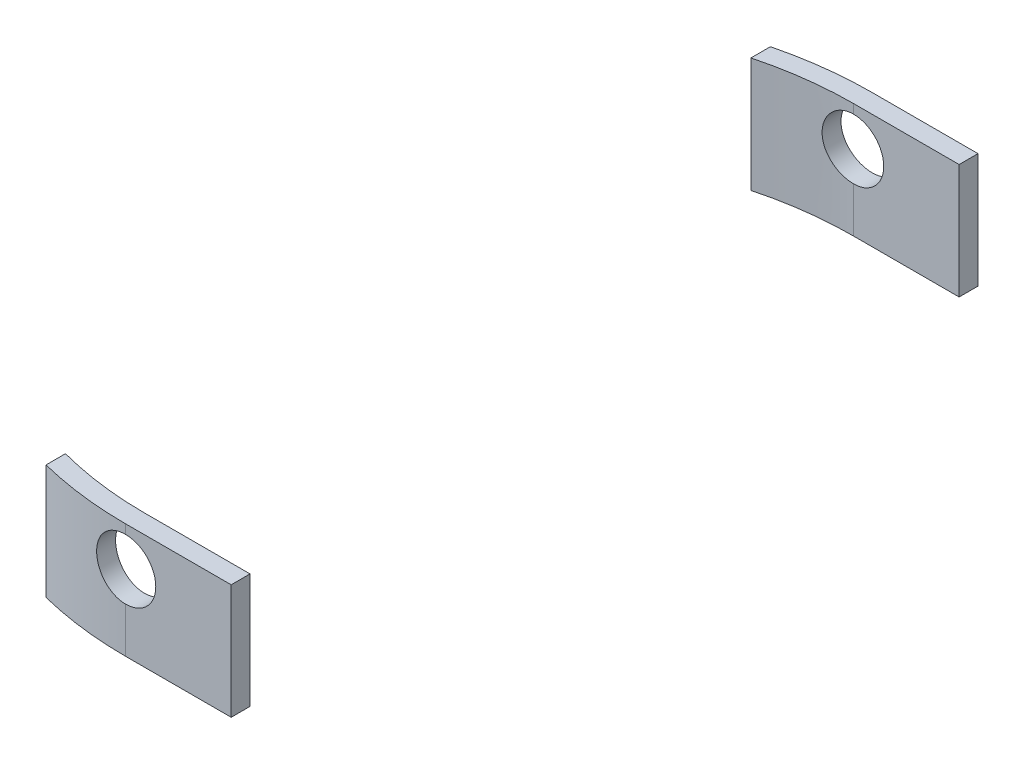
ISO-10303-21;
HEADER;
FILE_DESCRIPTION(('STEP AP214'),'2;1');
FILE_NAME('part.step','',(''),(''),'','','');
FILE_SCHEMA(('AUTOMOTIVE_DESIGN { 1 0 10303 214 1 1 1 1 }'));
ENDSEC;
DATA;
#1=APPLICATION_CONTEXT('core data for automotive mechanical design processes');
#2=APPLICATION_PROTOCOL_DEFINITION('international standard','automotive_design',2000,#1);
#3=PRODUCT_CONTEXT('',#1,'mechanical');
#4=PRODUCT('Part','Part','',(#3));
#5=PRODUCT_RELATED_PRODUCT_CATEGORY('part','',(#4));
#6=PRODUCT_DEFINITION_FORMATION('','',#4);
#7=PRODUCT_DEFINITION_CONTEXT('part definition',#1,'design');
#8=PRODUCT_DEFINITION('design','',#6,#7);
#9=PRODUCT_DEFINITION_SHAPE('','',#8);
#10=(LENGTH_UNIT() NAMED_UNIT(*) SI_UNIT(.MILLI.,.METRE.));
#11=(NAMED_UNIT(*) PLANE_ANGLE_UNIT() SI_UNIT($,.RADIAN.));
#12=(NAMED_UNIT(*) SI_UNIT($,.STERADIAN.) SOLID_ANGLE_UNIT());
#13=UNCERTAINTY_MEASURE_WITH_UNIT(LENGTH_MEASURE(1.E-05),#10,'distance_accuracy_value','');
#14=(GEOMETRIC_REPRESENTATION_CONTEXT(3) GLOBAL_UNCERTAINTY_ASSIGNED_CONTEXT((#13)) GLOBAL_UNIT_ASSIGNED_CONTEXT((#10,
#11,#12)) REPRESENTATION_CONTEXT('',''));
#15=CARTESIAN_POINT('',(0.,0.,0.));
#16=DIRECTION('',(0.,0.,1.));
#17=DIRECTION('',(1.,0.,0.));
#18=AXIS2_PLACEMENT_3D('',#15,#16,#17);
#19=CARTESIAN_POINT('',(0.,18.3,0.));
#20=DIRECTION('',(0.,1.,0.));
#21=DIRECTION('',(0.,0.,1.));
#22=AXIS2_PLACEMENT_3D('',#19,#20,#21);
#23=PLANE('',#22);
#24=DIRECTION('',(0.,0.,-1.));
#25=VECTOR('',#24,1.);
#26=CARTESIAN_POINT('',(-4.81519163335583,18.3,0.));
#27=LINE('',#26,#25);
#28=CARTESIAN_POINT('',(-4.81519163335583,18.3,19.2055702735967));
#29=VERTEX_POINT('',#28);
#30=CARTESIAN_POINT('',(-4.81519163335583,18.3,18.1728899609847));
#31=VERTEX_POINT('',#30);
#32=EDGE_CURVE('E88',#29,#31,#27,.T.);
#33=ORIENTED_EDGE('',*,*,#32,.F.);
#34=CARTESIAN_POINT('',(0.,18.3,0.));
#35=DIRECTION('',(0.,1.,0.));
#36=DIRECTION('',(0.,0.,1.));
#37=AXIS2_PLACEMENT_3D('',#34,#35,#36);
#38=CIRCLE('',#37,19.8);
#39=CARTESIAN_POINT('',(0.,18.3,19.8));
#40=VERTEX_POINT('',#39);
#41=EDGE_CURVE('E195',#29,#40,#38,.T.);
#42=ORIENTED_EDGE('',*,*,#41,.T.);
#43=DIRECTION('',(1.,0.,0.));
#44=VECTOR('',#43,1.);
#45=CARTESIAN_POINT('',(0.,18.3,19.8));
#46=LINE('',#45,#44);
#47=CARTESIAN_POINT('',(5.59934207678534,18.3,19.8));
#48=VERTEX_POINT('',#47);
#49=EDGE_CURVE('E197',#40,#48,#46,.T.);
#50=ORIENTED_EDGE('',*,*,#49,.T.);
#51=DIRECTION('',(0.,0.,1.));
#52=VECTOR('',#51,1.);
#53=CARTESIAN_POINT('',(5.59934207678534,18.3,0.));
#54=LINE('',#53,#52);
#55=CARTESIAN_POINT('',(5.59934207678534,18.3,18.8));
#56=VERTEX_POINT('',#55);
#57=EDGE_CURVE('E134',#56,#48,#54,.T.);
#58=ORIENTED_EDGE('',*,*,#57,.F.);
#59=DIRECTION('',(1.,0.,0.));
#60=VECTOR('',#59,1.);
#61=CARTESIAN_POINT('',(7.59934207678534,18.3,18.8));
#62=LINE('',#61,#60);
#63=CARTESIAN_POINT('',(0.,18.3,18.8));
#64=VERTEX_POINT('',#63);
#65=EDGE_CURVE('E135',#64,#56,#62,.T.);
#66=ORIENTED_EDGE('',*,*,#65,.F.);
#67=CARTESIAN_POINT('',(0.,18.3,0.));
#68=DIRECTION('',(0.,1.,0.));
#69=DIRECTION('',(0.,0.,1.));
#70=AXIS2_PLACEMENT_3D('',#67,#68,#69);
#71=CIRCLE('',#70,18.8);
#72=EDGE_CURVE('E144',#31,#64,#71,.T.);
#73=ORIENTED_EDGE('',*,*,#72,.F.);
#74=EDGE_LOOP('',(#33,#42,#50,#58,#66,#73));
#75=FACE_BOUND('',#74,.T.);
#76=ADVANCED_FACE('F50',(#75),#23,.T.);
#77=CARTESIAN_POINT('',(0.,-57.0073400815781,0.));
#78=DIRECTION('',(0.,1.,0.));
#79=DIRECTION('',(0.,0.,1.));
#80=AXIS2_PLACEMENT_3D('',#77,#78,#79);
#81=CYLINDRICAL_SURFACE('',#80,19.8);
#82=DIRECTION('',(0.,1.,0.));
#83=VECTOR('',#82,1.);
#84=CARTESIAN_POINT('',(-4.81519163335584,-57.0073400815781,19.2055702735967));
#85=LINE('',#84,#83);
#86=CARTESIAN_POINT('',(-4.81519163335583,12.2142492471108,19.2055702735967));
#87=VERTEX_POINT('',#86);
#88=EDGE_CURVE('E198',#87,#29,#85,.T.);
#89=ORIENTED_EDGE('',*,*,#88,.F.);
#90=CARTESIAN_POINT('',(0.,12.2142492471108,0.));
#91=DIRECTION('',(0.,1.,0.));
#92=DIRECTION('',(0.,0.,1.));
#93=AXIS2_PLACEMENT_3D('',#90,#91,#92);
#94=CIRCLE('',#93,19.8);
#95=CARTESIAN_POINT('',(0.,12.2142492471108,19.8));
#96=VERTEX_POINT('',#95);
#97=EDGE_CURVE('E60',#96,#87,#94,.F.);
#98=ORIENTED_EDGE('',*,*,#97,.F.);
#99=DIRECTION('',(0.,1.,0.));
#100=VECTOR('',#99,1.);
#101=CARTESIAN_POINT('',(0.,-57.0073400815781,19.8));
#102=LINE('',#101,#100);
#103=CARTESIAN_POINT('',(0.,14.6125,19.8));
#104=VERTEX_POINT('',#103);
#105=EDGE_CURVE('E210',#96,#104,#102,.T.);
#106=ORIENTED_EDGE('',*,*,#105,.T.);
#107=CARTESIAN_POINT('',(0.,17.8125,19.8));
#108=CARTESIAN_POINT('',(-0.0449365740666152,17.8124997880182,19.800000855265));
#109=CARTESIAN_POINT('',(-0.0898515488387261,17.8106057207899,19.799846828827));
#110=CARTESIAN_POINT('',(-0.179358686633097,17.8030500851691,19.7992380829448));
#111=CARTESIAN_POINT('',(-0.223950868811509,17.7973887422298,19.7987833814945));
#112=CARTESIAN_POINT('',(-0.3566787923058,17.7748098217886,19.7969839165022));
#113=CARTESIAN_POINT('',(-0.44392318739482,17.7522971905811,19.7952037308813));
#114=CARTESIAN_POINT('',(-0.613375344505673,17.6929875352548,19.7906791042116));
#115=CARTESIAN_POINT('',(-0.695581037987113,17.6561846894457,19.7879342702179));
#116=CARTESIAN_POINT('',(-0.852648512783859,17.5693483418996,19.7817888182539));
#117=CARTESIAN_POINT('',(-0.927511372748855,17.5193167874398,19.7783882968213));
#118=CARTESIAN_POINT('',(-1.06793655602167,17.4073201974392,19.7713043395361));
#119=CARTESIAN_POINT('',(-1.13347956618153,17.345330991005,19.7676203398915));
#120=CARTESIAN_POINT('',(-1.25325144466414,17.2112212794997,19.7603889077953));
#121=CARTESIAN_POINT('',(-1.30747858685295,17.1390992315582,19.7568414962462));
#122=CARTESIAN_POINT('',(-1.40313531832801,16.9866571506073,19.7502790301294));
#123=CARTESIAN_POINT('',(-1.44454760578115,16.9063262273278,19.7472646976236));
#124=CARTESIAN_POINT('',(-1.51328655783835,16.73982775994,19.7421163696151));
#125=CARTESIAN_POINT('',(-1.54061431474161,16.6536606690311,19.7399823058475));
#126=CARTESIAN_POINT('',(-1.58035441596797,16.4781308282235,19.7368406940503));
#127=CARTESIAN_POINT('',(-1.59279919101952,16.3887754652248,19.7358306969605));
#128=CARTESIAN_POINT('',(-1.60252032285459,16.209236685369,19.7350437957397));
#129=CARTESIAN_POINT('',(-1.59979657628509,16.1190532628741,19.7352669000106));
#130=CARTESIAN_POINT('',(-1.57928426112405,15.9406453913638,19.7369188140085));
#131=CARTESIAN_POINT('',(-1.56153136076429,15.8524168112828,19.738344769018));
#132=CARTESIAN_POINT('',(-1.51152014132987,15.680196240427,19.7422372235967));
#133=CARTESIAN_POINT('',(-1.47926175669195,15.5962042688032,19.7447037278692));
#134=CARTESIAN_POINT('',(-1.40111454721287,15.4347253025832,19.7504027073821));
#135=CARTESIAN_POINT('',(-1.35520941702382,15.3572462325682,19.7536360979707));
#136=CARTESIAN_POINT('',(-1.25108565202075,15.211083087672,19.7605034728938));
#137=CARTESIAN_POINT('',(-1.1928673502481,15.1423987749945,19.7641374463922));
#138=CARTESIAN_POINT('',(-1.06557912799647,15.0155724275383,19.7714088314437));
#139=CARTESIAN_POINT('',(-0.996479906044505,14.9574597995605,19.7750462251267));
#140=CARTESIAN_POINT('',(-0.849463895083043,14.8536367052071,19.7819062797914));
#141=CARTESIAN_POINT('',(-0.771544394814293,14.8079300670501,19.7851288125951));
#142=CARTESIAN_POINT('',(-0.609070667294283,14.7302200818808,19.7907969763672));
#143=CARTESIAN_POINT('',(-0.524511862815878,14.6982262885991,19.7932420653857));
#144=CARTESIAN_POINT('',(-0.351262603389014,14.6489466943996,19.7970726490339));
#145=CARTESIAN_POINT('',(-0.262578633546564,14.6316385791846,19.7984597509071));
#146=CARTESIAN_POINT('',(-0.144403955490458,14.6187651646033,19.7994946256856));
#147=CARTESIAN_POINT('',(-0.115548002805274,14.616414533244,19.7996840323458));
#148=CARTESIAN_POINT('',(-0.0577986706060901,14.6132840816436,19.7999365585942));
#149=CARTESIAN_POINT('',(-0.0289054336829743,14.612501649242,19.7999998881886));
#150=CARTESIAN_POINT('',(0.,14.6125,19.8));
#151=B_SPLINE_CURVE_WITH_KNOTS('',3,(#107,#108,#109,#110,#111,#112,#113,#114,#115,#116,#117,
#118,#119,#120,#121,#122,#123,#124,#125,#126,#127,#128,#129,#130,#131,#132,#133,#134,#135,#136,
#137,#138,#139,#140,#141,#142,#143,#144,#145,#146,#147,#148,#149,#150),.UNSPECIFIED.,.F.,.F.,(4,
2,2,2,2,2,2,2,2,2,2,2,2,2,2,2,2,2,2,2,2,4),(0.,0.134726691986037,0.26944532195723,
0.538416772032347,0.807497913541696,1.07653946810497,1.34613066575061,1.6157629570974,
1.8857577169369,2.15573153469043,2.42511598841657,2.69450227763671,2.96325102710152,
3.23200099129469,3.5010733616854,3.77013845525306,4.03994091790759,4.30982654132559,
4.57989988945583,4.84956213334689,4.93638814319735,5.02306940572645),.UNSPECIFIED.);
#152=CARTESIAN_POINT('',(0.,17.8125,19.8));
#153=VERTEX_POINT('',#152);
#154=EDGE_CURVE('E151',#153,#104,#151,.T.);
#155=ORIENTED_EDGE('',*,*,#154,.F.);
#156=EDGE_CURVE('E150',#153,#40,#102,.T.);
#157=ORIENTED_EDGE('',*,*,#156,.T.);
#158=ORIENTED_EDGE('',*,*,#41,.F.);
#159=EDGE_LOOP('',(#89,#98,#106,#155,#157,#158));
#160=FACE_BOUND('',#159,.T.);
#161=ADVANCED_FACE('F166',(#160),#81,.T.);
#162=CARTESIAN_POINT('',(0.,-57.0073400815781,19.8));
#163=DIRECTION('',(0.,0.,1.));
#164=DIRECTION('',(1.,0.,0.));
#165=AXIS2_PLACEMENT_3D('',#162,#163,#164);
#166=PLANE('',#165);
#167=DIRECTION('',(-1.,0.,0.));
#168=VECTOR('',#167,1.);
#169=CARTESIAN_POINT('',(0.,12.2142492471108,19.8));
#170=LINE('',#169,#168);
#171=CARTESIAN_POINT('',(5.59934207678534,12.2142492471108,19.8));
#172=VERTEX_POINT('',#171);
#173=EDGE_CURVE('E12',#172,#96,#170,.T.);
#174=ORIENTED_EDGE('',*,*,#173,.F.);
#175=DIRECTION('',(0.,1.,0.));
#176=VECTOR('',#175,1.);
#177=CARTESIAN_POINT('',(5.59934207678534,7.3,19.8));
#178=LINE('',#177,#176);
#179=EDGE_CURVE('E133',#172,#48,#178,.T.);
#180=ORIENTED_EDGE('',*,*,#179,.T.);
#181=ORIENTED_EDGE('',*,*,#49,.F.);
#182=ORIENTED_EDGE('',*,*,#156,.F.);
#183=CARTESIAN_POINT('',(0.,16.2125,19.8));
#184=DIRECTION('',(0.,0.,1.));
#185=DIRECTION('',(1.,0.,0.));
#186=AXIS2_PLACEMENT_3D('',#183,#184,#185);
#187=CIRCLE('',#186,1.6);
#188=EDGE_CURVE('E159',#104,#153,#187,.T.);
#189=ORIENTED_EDGE('',*,*,#188,.F.);
#190=ORIENTED_EDGE('',*,*,#105,.F.);
#191=EDGE_LOOP('',(#174,#180,#181,#182,#189,#190));
#192=FACE_BOUND('',#191,.T.);
#193=ADVANCED_FACE('F183',(#192),#166,.T.);
#194=CARTESIAN_POINT('',(0.,-57.0073400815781,0.));
#195=DIRECTION('',(0.,1.,0.));
#196=DIRECTION('',(0.,0.,1.));
#197=AXIS2_PLACEMENT_3D('',#194,#195,#196);
#198=CYLINDRICAL_SURFACE('',#197,18.8);
#199=CARTESIAN_POINT('',(0.,12.2142492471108,0.));
#200=DIRECTION('',(0.,1.,0.));
#201=DIRECTION('',(0.,0.,1.));
#202=AXIS2_PLACEMENT_3D('',#199,#200,#201);
#203=CIRCLE('',#202,18.8);
#204=CARTESIAN_POINT('',(0.,12.2142492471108,18.8));
#205=VERTEX_POINT('',#204);
#206=CARTESIAN_POINT('',(-4.81519163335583,12.2142492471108,18.1728899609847));
#207=VERTEX_POINT('',#206);
#208=EDGE_CURVE('E121',#205,#207,#203,.F.);
#209=ORIENTED_EDGE('',*,*,#208,.T.);
#210=DIRECTION('',(0.,1.,0.));
#211=VECTOR('',#210,1.);
#212=CARTESIAN_POINT('',(-4.81519163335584,-57.0073400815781,18.1728899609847));
#213=LINE('',#212,#211);
#214=EDGE_CURVE('E85',#207,#31,#213,.T.);
#215=ORIENTED_EDGE('',*,*,#214,.T.);
#216=ORIENTED_EDGE('',*,*,#72,.T.);
#217=DIRECTION('',(0.,1.,0.));
#218=VECTOR('',#217,1.);
#219=CARTESIAN_POINT('',(0.,-57.0073400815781,18.8));
#220=LINE('',#219,#218);
#221=CARTESIAN_POINT('',(0.,17.8125,18.8));
#222=VERTEX_POINT('',#221);
#223=EDGE_CURVE('E217',#222,#64,#220,.T.);
#224=ORIENTED_EDGE('',*,*,#223,.F.);
#225=CARTESIAN_POINT('',(0.,17.8125,18.8));
#226=CARTESIAN_POINT('',(-0.0449280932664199,17.8124997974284,18.8000009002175));
#227=CARTESIAN_POINT('',(-0.0898345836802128,17.8106064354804,18.7998387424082));
#228=CARTESIAN_POINT('',(-0.179324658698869,17.8030536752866,18.7991978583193));
#229=CARTESIAN_POINT('',(-0.223908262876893,17.7973945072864,18.7987191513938));
#230=CARTESIAN_POINT('',(-0.356609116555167,17.7748246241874,18.7968247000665));
#231=CARTESIAN_POINT('',(-0.443834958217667,17.7523213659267,18.7949505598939));
#232=CARTESIAN_POINT('',(-0.613250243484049,17.693038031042,18.790187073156));
#233=CARTESIAN_POINT('',(-0.695437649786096,17.656252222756,18.7872973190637));
#234=CARTESIAN_POINT('',(-0.852472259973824,17.5694574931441,18.7808271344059));
#235=CARTESIAN_POINT('',(-0.927320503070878,17.5194504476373,18.7772468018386));
#236=CARTESIAN_POINT('',(-1.06773832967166,17.4074968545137,18.7697869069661));
#237=CARTESIAN_POINT('',(-1.13328654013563,17.3455235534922,18.7659066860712));
#238=CARTESIAN_POINT('',(-1.25307276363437,17.2114448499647,18.7582893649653));
#239=CARTESIAN_POINT('',(-1.30730905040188,17.13933790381,18.7545522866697));
#240=CARTESIAN_POINT('',(-1.40299578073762,16.9869109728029,18.7476376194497));
#241=CARTESIAN_POINT('',(-1.44442694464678,16.9065788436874,18.7444608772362));
#242=CARTESIAN_POINT('',(-1.51320221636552,16.7400715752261,18.7390345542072));
#243=CARTESIAN_POINT('',(-1.54054743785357,16.6538968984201,18.736784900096));
#244=CARTESIAN_POINT('',(-1.58031413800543,16.4783676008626,18.7334729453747));
#245=CARTESIAN_POINT('',(-1.59277160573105,16.3890211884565,18.7324077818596));
#246=CARTESIAN_POINT('',(-1.60252044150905,16.2094974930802,18.7315763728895));
#247=CARTESIAN_POINT('',(-1.59981173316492,16.119320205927,18.7318101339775));
#248=CARTESIAN_POINT('',(-1.57933430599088,15.9409463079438,18.7335476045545));
#249=CARTESIAN_POINT('',(-1.56160516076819,15.8527451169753,18.735047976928));
#250=CARTESIAN_POINT('',(-1.51165167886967,15.6805753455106,18.7391443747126));
#251=CARTESIAN_POINT('',(-1.47942726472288,15.5966067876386,18.7417404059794));
#252=CARTESIAN_POINT('',(-1.40135302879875,15.435157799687,18.7477395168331));
#253=CARTESIAN_POINT('',(-1.35548519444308,15.3576861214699,18.7511436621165));
#254=CARTESIAN_POINT('',(-1.25144119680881,15.2115297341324,18.7583742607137));
#255=CARTESIAN_POINT('',(-1.19326533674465,15.1428448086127,18.7622007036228));
#256=CARTESIAN_POINT('',(-1.06604424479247,15.0159865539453,18.7698591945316));
#257=CARTESIAN_POINT('',(-0.996966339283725,14.957845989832,18.7736912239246));
#258=CARTESIAN_POINT('',(-0.84998634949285,14.8539632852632,18.7809192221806));
#259=CARTESIAN_POINT('',(-0.772081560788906,14.8082249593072,18.7843150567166));
#260=CARTESIAN_POINT('',(-0.609627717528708,14.7304487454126,18.7902891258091));
#261=CARTESIAN_POINT('',(-0.525073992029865,14.6984205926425,18.7928667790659));
#262=CARTESIAN_POINT('',(-0.351826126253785,14.6490729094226,18.7969063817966));
#263=CARTESIAN_POINT('',(-0.263138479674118,14.631731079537,18.7983700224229));
#264=CARTESIAN_POINT('',(-0.144865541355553,14.6188053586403,18.7994643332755));
#265=CARTESIAN_POINT('',(-0.115917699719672,14.6164396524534,18.7996650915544));
#266=CARTESIAN_POINT('',(-0.0579838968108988,14.6132891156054,18.7999327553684));
#267=CARTESIAN_POINT('',(-0.0289980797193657,14.6125016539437,18.7999998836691));
#268=CARTESIAN_POINT('',(0.,14.6125,18.8));
#269=B_SPLINE_CURVE_WITH_KNOTS('',3,(#225,#226,#227,#228,#229,#230,#231,#232,#233,#234,#235,
#236,#237,#238,#239,#240,#241,#242,#243,#244,#245,#246,#247,#248,#249,#250,#251,#252,#253,#254,
#255,#256,#257,#258,#259,#260,#261,#262,#263,#264,#265,#266,#267,#268),.UNSPECIFIED.,.F.,.F.,(4,
2,2,2,2,2,2,2,2,2,2,2,2,2,2,2,2,2,2,2,2,4),(0.,0.13470124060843,0.269394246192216,
0.538310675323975,0.807335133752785,1.07632144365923,1.3459162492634,1.61555216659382,
1.88559209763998,2.15561067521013,2.42497519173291,2.69434106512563,2.96299945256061,
3.23165927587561,3.50067538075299,3.76968485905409,4.03951643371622,4.30943090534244,
4.57953671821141,4.84923166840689,4.93633595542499,5.02329491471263),.UNSPECIFIED.);
#270=CARTESIAN_POINT('',(0.,14.6125,18.8));
#271=VERTEX_POINT('',#270);
#272=EDGE_CURVE('E141',#222,#271,#269,.T.);
#273=ORIENTED_EDGE('',*,*,#272,.T.);
#274=EDGE_CURVE('E125',#205,#271,#220,.T.);
#275=ORIENTED_EDGE('',*,*,#274,.F.);
#276=EDGE_LOOP('',(#209,#215,#216,#224,#273,#275));
#277=FACE_BOUND('',#276,.T.);
#278=ADVANCED_FACE('F180',(#277),#198,.F.);
#279=CARTESIAN_POINT('',(7.59934207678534,-57.0073400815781,18.8));
#280=DIRECTION('',(0.,0.,1.));
#281=DIRECTION('',(1.,0.,0.));
#282=AXIS2_PLACEMENT_3D('',#279,#280,#281);
#283=PLANE('',#282);
#284=DIRECTION('',(0.,-1.,0.));
#285=VECTOR('',#284,1.);
#286=CARTESIAN_POINT('',(5.59934207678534,-57.0073400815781,18.8));
#287=LINE('',#286,#285);
#288=CARTESIAN_POINT('',(5.59934207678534,12.2142492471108,18.8));
#289=VERTEX_POINT('',#288);
#290=EDGE_CURVE('E126',#56,#289,#287,.T.);
#291=ORIENTED_EDGE('',*,*,#290,.T.);
#292=DIRECTION('',(-1.,0.,0.));
#293=VECTOR('',#292,1.);
#294=CARTESIAN_POINT('',(7.59934207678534,12.2142492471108,18.8));
#295=LINE('',#294,#293);
#296=EDGE_CURVE('E116',#289,#205,#295,.T.);
#297=ORIENTED_EDGE('',*,*,#296,.T.);
#298=ORIENTED_EDGE('',*,*,#274,.T.);
#299=CARTESIAN_POINT('',(0.,16.2125,18.8));
#300=DIRECTION('',(0.,0.,1.));
#301=DIRECTION('',(1.,0.,0.));
#302=AXIS2_PLACEMENT_3D('',#299,#300,#301);
#303=CIRCLE('',#302,1.6);
#304=EDGE_CURVE('E216',#271,#222,#303,.T.);
#305=ORIENTED_EDGE('',*,*,#304,.T.);
#306=ORIENTED_EDGE('',*,*,#223,.T.);
#307=ORIENTED_EDGE('',*,*,#65,.T.);
#308=EDGE_LOOP('',(#291,#297,#298,#305,#306,#307));
#309=FACE_BOUND('',#308,.T.);
#310=ADVANCED_FACE('F138',(#309),#283,.F.);
#311=CARTESIAN_POINT('',(5.59934207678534,7.3,-19.8));
#312=DIRECTION('',(-1.,0.,0.));
#313=DIRECTION('',(0.,0.,1.));
#314=AXIS2_PLACEMENT_3D('',#311,#312,#313);
#315=PLANE('',#314);
#316=ORIENTED_EDGE('',*,*,#179,.F.);
#317=DIRECTION('',(0.,0.,-1.));
#318=VECTOR('',#317,1.);
#319=CARTESIAN_POINT('',(5.59934207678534,12.2142492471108,-19.8));
#320=LINE('',#319,#318);
#321=EDGE_CURVE('E119',#172,#289,#320,.T.);
#322=ORIENTED_EDGE('',*,*,#321,.T.);
#323=ORIENTED_EDGE('',*,*,#290,.F.);
#324=ORIENTED_EDGE('',*,*,#57,.T.);
#325=EDGE_LOOP('',(#316,#322,#323,#324));
#326=FACE_BOUND('',#325,.T.);
#327=ADVANCED_FACE('F130',(#326),#315,.F.);
#328=CARTESIAN_POINT('',(0.,16.2125,18.6));
#329=DIRECTION('',(0.,0.,1.));
#330=DIRECTION('',(1.,0.,0.));
#331=AXIS2_PLACEMENT_3D('',#328,#329,#330);
#332=CYLINDRICAL_SURFACE('',#331,1.6);
#333=ORIENTED_EDGE('',*,*,#154,.T.);
#334=ORIENTED_EDGE('',*,*,#188,.T.);
#335=EDGE_LOOP('',(#333,#334));
#336=FACE_BOUND('',#335,.T.);
#337=ORIENTED_EDGE('',*,*,#304,.F.);
#338=ORIENTED_EDGE('',*,*,#272,.F.);
#339=EDGE_LOOP('',(#337,#338));
#340=FACE_BOUND('',#339,.T.);
#341=ADVANCED_FACE('F168',(#336,#340),#332,.F.);
#342=CARTESIAN_POINT('',(-4.81519163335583,21.6132217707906,-30.2));
#343=DIRECTION('',(1.,0.,0.));
#344=DIRECTION('',(0.,1.,0.));
#345=AXIS2_PLACEMENT_3D('',#342,#343,#344);
#346=PLANE('',#345);
#347=ORIENTED_EDGE('',*,*,#88,.T.);
#348=ORIENTED_EDGE('',*,*,#32,.T.);
#349=ORIENTED_EDGE('',*,*,#214,.F.);
#350=DIRECTION('',(0.,0.,1.));
#351=VECTOR('',#350,1.);
#352=CARTESIAN_POINT('',(-4.81519163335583,12.2142492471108,-30.2));
#353=LINE('',#352,#351);
#354=EDGE_CURVE('E54',#207,#87,#353,.T.);
#355=ORIENTED_EDGE('',*,*,#354,.T.);
#356=EDGE_LOOP('',(#347,#348,#349,#355));
#357=FACE_BOUND('',#356,.T.);
#358=ADVANCED_FACE('F52',(#357),#346,.F.);
#359=CARTESIAN_POINT('',(-4.81519163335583,12.2142492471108,-30.2));
#360=DIRECTION('',(0.,1.,0.));
#361=DIRECTION('',(0.,0.,1.));
#362=AXIS2_PLACEMENT_3D('',#359,#360,#361);
#363=PLANE('',#362);
#364=ORIENTED_EDGE('',*,*,#97,.T.);
#365=ORIENTED_EDGE('',*,*,#354,.F.);
#366=ORIENTED_EDGE('',*,*,#208,.F.);
#367=ORIENTED_EDGE('',*,*,#296,.F.);
#368=ORIENTED_EDGE('',*,*,#321,.F.);
#369=ORIENTED_EDGE('',*,*,#173,.T.);
#370=EDGE_LOOP('',(#364,#365,#366,#367,#368,#369));
#371=FACE_BOUND('',#370,.T.);
#372=ADVANCED_FACE('F118',(#371),#363,.F.);
#373=CLOSED_SHELL('',(#76,#161,#193,#278,#310,#327,#341,#358,#372));
#374=MANIFOLD_SOLID_BREP('B2',#373);
#375=CARTESIAN_POINT('',(0.,16.2125,-18.6));
#376=DIRECTION('',(0.,0.,-1.));
#377=DIRECTION('',(-1.,0.,0.));
#378=AXIS2_PLACEMENT_3D('',#375,#376,#377);
#379=CYLINDRICAL_SURFACE('',#378,1.6);
#380=CARTESIAN_POINT('',(0.,14.6125,-19.8));
#381=CARTESIAN_POINT('',(-0.0449365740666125,14.6125002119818,-19.800000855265));
#382=CARTESIAN_POINT('',(-0.0898515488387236,14.6143942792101,-19.799846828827));
#383=CARTESIAN_POINT('',(-0.179358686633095,14.6219499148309,-19.7992380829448));
#384=CARTESIAN_POINT('',(-0.223950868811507,14.6276112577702,-19.7987833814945));
#385=CARTESIAN_POINT('',(-0.356678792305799,14.6501901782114,-19.7969839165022));
#386=CARTESIAN_POINT('',(-0.443923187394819,14.6727028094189,-19.7952037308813));
#387=CARTESIAN_POINT('',(-0.613375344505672,14.7320124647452,-19.7906791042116));
#388=CARTESIAN_POINT('',(-0.695581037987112,14.7688153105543,-19.7879342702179));
#389=CARTESIAN_POINT('',(-0.85264851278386,14.8556516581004,-19.7817888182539));
#390=CARTESIAN_POINT('',(-0.927511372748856,14.9056832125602,-19.7783882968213));
#391=CARTESIAN_POINT('',(-1.06793655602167,15.0176798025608,-19.7713043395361));
#392=CARTESIAN_POINT('',(-1.13347956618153,15.079669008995,-19.7676203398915));
#393=CARTESIAN_POINT('',(-1.25325144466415,15.2137787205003,-19.7603889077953));
#394=CARTESIAN_POINT('',(-1.30747858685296,15.2859007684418,-19.7568414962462));
#395=CARTESIAN_POINT('',(-1.40313531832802,15.4383428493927,-19.7502790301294));
#396=CARTESIAN_POINT('',(-1.44454760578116,15.5186737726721,-19.7472646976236));
#397=CARTESIAN_POINT('',(-1.51328655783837,15.68517224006,-19.7421163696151));
#398=CARTESIAN_POINT('',(-1.54061431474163,15.7713393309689,-19.7399823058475));
#399=CARTESIAN_POINT('',(-1.58035441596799,15.9468691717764,-19.7368406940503));
#400=CARTESIAN_POINT('',(-1.59279919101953,16.0362245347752,-19.7358306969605));
#401=CARTESIAN_POINT('',(-1.60252032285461,16.215763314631,-19.7350437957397));
#402=CARTESIAN_POINT('',(-1.59979657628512,16.3059467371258,-19.7352669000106));
#403=CARTESIAN_POINT('',(-1.57928426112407,16.4843546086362,-19.7369188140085));
#404=CARTESIAN_POINT('',(-1.56153136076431,16.5725831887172,-19.738344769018));
#405=CARTESIAN_POINT('',(-1.5115201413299,16.7448037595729,-19.7422372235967));
#406=CARTESIAN_POINT('',(-1.47926175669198,16.8287957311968,-19.7447037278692));
#407=CARTESIAN_POINT('',(-1.4011145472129,16.9902746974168,-19.7504027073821));
#408=CARTESIAN_POINT('',(-1.35520941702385,17.0677537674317,-19.7536360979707));
#409=CARTESIAN_POINT('',(-1.25108565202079,17.213916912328,-19.7605034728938));
#410=CARTESIAN_POINT('',(-1.19286735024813,17.2826012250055,-19.7641374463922));
#411=CARTESIAN_POINT('',(-1.0655791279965,17.4094275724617,-19.7714088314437));
#412=CARTESIAN_POINT('',(-0.996479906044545,17.4675402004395,-19.7750462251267));
#413=CARTESIAN_POINT('',(-0.849463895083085,17.5713632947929,-19.7819062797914));
#414=CARTESIAN_POINT('',(-0.771544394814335,17.6170699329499,-19.7851288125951));
#415=CARTESIAN_POINT('',(-0.609070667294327,17.6947799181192,-19.7907969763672));
#416=CARTESIAN_POINT('',(-0.524511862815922,17.7267737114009,-19.7932420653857));
#417=CARTESIAN_POINT('',(-0.351262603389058,17.7760533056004,-19.7970726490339));
#418=CARTESIAN_POINT('',(-0.262578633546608,17.7933614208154,-19.7984597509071));
#419=CARTESIAN_POINT('',(-0.144403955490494,17.8062348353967,-19.7994946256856));
#420=CARTESIAN_POINT('',(-0.115548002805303,17.808585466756,-19.7996840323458));
#421=CARTESIAN_POINT('',(-0.0577986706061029,17.8117159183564,-19.7999365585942));
#422=CARTESIAN_POINT('',(-0.0289054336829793,17.8124983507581,-19.7999998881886));
#423=CARTESIAN_POINT('',(0.,17.8125,-19.8));
#424=B_SPLINE_CURVE_WITH_KNOTS('',3,(#380,#381,#382,#383,#384,#385,#386,#387,#388,#389,#390,
#391,#392,#393,#394,#395,#396,#397,#398,#399,#400,#401,#402,#403,#404,#405,#406,#407,#408,#409,
#410,#411,#412,#413,#414,#415,#416,#417,#418,#419,#420,#421,#422,#423),.UNSPECIFIED.,.F.,.F.,(4,
2,2,2,2,2,2,2,2,2,2,2,2,2,2,2,2,2,2,2,2,4),(0.,0.134726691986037,0.269445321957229,
0.538416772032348,0.807497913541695,1.07653946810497,1.3461306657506,1.6157629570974,
1.8857577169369,2.15573153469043,2.42511598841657,2.69450227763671,2.96325102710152,
3.23200099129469,3.5010733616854,3.77013845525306,4.03994091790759,4.30982654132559,
4.57989988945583,4.84956213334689,4.93638814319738,5.0230694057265),.UNSPECIFIED.);
#425=CARTESIAN_POINT('',(0.,14.6125,-19.8));
#426=VERTEX_POINT('',#425);
#427=CARTESIAN_POINT('',(0.,17.8125,-19.8));
#428=VERTEX_POINT('',#427);
#429=EDGE_CURVE('E392',#426,#428,#424,.T.);
#430=ORIENTED_EDGE('',*,*,#429,.T.);
#431=CARTESIAN_POINT('',(0.,16.2125,-19.8));
#432=DIRECTION('',(0.,0.,-1.));
#433=DIRECTION('',(-1.,0.,0.));
#434=AXIS2_PLACEMENT_3D('',#431,#432,#433);
#435=CIRCLE('',#434,1.6);
#436=EDGE_CURVE('E372',#428,#426,#435,.T.);
#437=ORIENTED_EDGE('',*,*,#436,.T.);
#438=EDGE_LOOP('',(#430,#437));
#439=FACE_BOUND('',#438,.T.);
#440=CARTESIAN_POINT('',(0.,14.6125,-18.8));
#441=CARTESIAN_POINT('',(-0.044928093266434,14.6125002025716,-18.8000009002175));
#442=CARTESIAN_POINT('',(-0.0898345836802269,14.6143935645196,-18.7998387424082));
#443=CARTESIAN_POINT('',(-0.179324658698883,14.6219463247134,-18.7991978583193));
#444=CARTESIAN_POINT('',(-0.223908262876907,14.6276054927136,-18.7987191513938));
#445=CARTESIAN_POINT('',(-0.356609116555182,14.6501753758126,-18.7968247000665));
#446=CARTESIAN_POINT('',(-0.443834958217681,14.6726786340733,-18.7949505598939));
#447=CARTESIAN_POINT('',(-0.613250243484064,14.731961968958,-18.790187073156));
#448=CARTESIAN_POINT('',(-0.695437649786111,14.768747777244,-18.7872973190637));
#449=CARTESIAN_POINT('',(-0.852472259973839,14.8555425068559,-18.7808271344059));
#450=CARTESIAN_POINT('',(-0.927320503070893,14.9055495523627,-18.7772468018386));
#451=CARTESIAN_POINT('',(-1.06773832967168,15.0175031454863,-18.7697869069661));
#452=CARTESIAN_POINT('',(-1.13328654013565,15.0794764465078,-18.7659066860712));
#453=CARTESIAN_POINT('',(-1.25307276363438,15.2135551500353,-18.7582893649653));
#454=CARTESIAN_POINT('',(-1.3073090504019,15.2856620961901,-18.7545522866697));
#455=CARTESIAN_POINT('',(-1.40299578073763,15.4380890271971,-18.7476376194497));
#456=CARTESIAN_POINT('',(-1.44442694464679,15.5184211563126,-18.7444608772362));
#457=CARTESIAN_POINT('',(-1.51320221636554,15.6849284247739,-18.7390345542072));
#458=CARTESIAN_POINT('',(-1.54054743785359,15.7711031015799,-18.736784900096));
#459=CARTESIAN_POINT('',(-1.58031413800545,15.9466323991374,-18.7334729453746));
#460=CARTESIAN_POINT('',(-1.59277160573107,16.0359788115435,-18.7324077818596));
#461=CARTESIAN_POINT('',(-1.60252044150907,16.2155025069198,-18.7315763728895));
#462=CARTESIAN_POINT('',(-1.59981173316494,16.305679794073,-18.7318101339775));
#463=CARTESIAN_POINT('',(-1.5793343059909,16.4840536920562,-18.7335476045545));
#464=CARTESIAN_POINT('',(-1.56160516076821,16.5722548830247,-18.735047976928));
#465=CARTESIAN_POINT('',(-1.51165167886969,16.7444246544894,-18.7391443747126));
#466=CARTESIAN_POINT('',(-1.47942726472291,16.8283932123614,-18.7417404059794));
#467=CARTESIAN_POINT('',(-1.40135302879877,16.989842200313,-18.7477395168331));
#468=CARTESIAN_POINT('',(-1.35548519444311,17.0673138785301,-18.7511436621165));
#469=CARTESIAN_POINT('',(-1.25144119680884,17.2134702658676,-18.7583742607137));
#470=CARTESIAN_POINT('',(-1.19326533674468,17.2821551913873,-18.7622007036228));
#471=CARTESIAN_POINT('',(-1.0660442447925,17.4090134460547,-18.7698591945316));
#472=CARTESIAN_POINT('',(-0.996966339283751,17.467154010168,-18.7736912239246));
#473=CARTESIAN_POINT('',(-0.849986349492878,17.5710367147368,-18.7809192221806));
#474=CARTESIAN_POINT('',(-0.772081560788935,17.6167750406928,-18.7843150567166));
#475=CARTESIAN_POINT('',(-0.609627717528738,17.6945512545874,-18.7902891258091));
#476=CARTESIAN_POINT('',(-0.525073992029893,17.7265794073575,-18.7928667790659));
#477=CARTESIAN_POINT('',(-0.351826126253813,17.7759270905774,-18.7969063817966));
#478=CARTESIAN_POINT('',(-0.263138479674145,17.793268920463,-18.7983700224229));
#479=CARTESIAN_POINT('',(-0.144865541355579,17.8061946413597,-18.7994643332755));
#480=CARTESIAN_POINT('',(-0.115917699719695,17.8085603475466,-18.7996650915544));
#481=CARTESIAN_POINT('',(-0.0579838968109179,17.8117108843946,-18.7999327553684));
#482=CARTESIAN_POINT('',(-0.0289980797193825,17.8124983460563,-18.7999998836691));
#483=CARTESIAN_POINT('',(0.,17.8125,-18.8));
#484=B_SPLINE_CURVE_WITH_KNOTS('',3,(#440,#441,#442,#443,#444,#445,#446,#447,#448,#449,#450,
#451,#452,#453,#454,#455,#456,#457,#458,#459,#460,#461,#462,#463,#464,#465,#466,#467,#468,#469,
#470,#471,#472,#473,#474,#475,#476,#477,#478,#479,#480,#481,#482,#483),.UNSPECIFIED.,.F.,.F.,(4,
2,2,2,2,2,2,2,2,2,2,2,2,2,2,2,2,2,2,2,2,4),(0.,0.13470124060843,0.269394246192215,
0.538310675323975,0.807335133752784,1.07632144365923,1.34591624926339,1.61555216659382,
1.88559209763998,2.15561067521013,2.42497519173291,2.69434106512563,2.9629994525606,
3.23165927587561,3.50067538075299,3.7696848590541,4.03951643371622,4.30943090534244,
4.5795367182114,4.84923166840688,4.93633595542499,5.02329491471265),.UNSPECIFIED.);
#485=CARTESIAN_POINT('',(0.,14.6125,-18.8));
#486=VERTEX_POINT('',#485);
#487=CARTESIAN_POINT('',(0.,17.8125,-18.8));
#488=VERTEX_POINT('',#487);
#489=EDGE_CURVE('E413',#486,#488,#484,.T.);
#490=ORIENTED_EDGE('',*,*,#489,.F.);
#491=CARTESIAN_POINT('',(0.,16.2125,-18.8));
#492=DIRECTION('',(0.,0.,-1.));
#493=DIRECTION('',(-1.,0.,0.));
#494=AXIS2_PLACEMENT_3D('',#491,#492,#493);
#495=CIRCLE('',#494,1.6);
#496=EDGE_CURVE('E389',#488,#486,#495,.T.);
#497=ORIENTED_EDGE('',*,*,#496,.F.);
#498=EDGE_LOOP('',(#490,#497));
#499=FACE_BOUND('',#498,.T.);
#500=ADVANCED_FACE('F297',(#439,#499),#379,.F.);
#501=CARTESIAN_POINT('',(5.59934207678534,7.3,-19.8));
#502=DIRECTION('',(-1.,0.,0.));
#503=DIRECTION('',(0.,0.,1.));
#504=AXIS2_PLACEMENT_3D('',#501,#502,#503);
#505=PLANE('',#504);
#506=DIRECTION('',(0.,1.,0.));
#507=VECTOR('',#506,1.);
#508=CARTESIAN_POINT('',(5.59934207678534,-57.0073400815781,-18.8));
#509=LINE('',#508,#507);
#510=CARTESIAN_POINT('',(5.59934207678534,12.2142492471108,-18.8));
#511=VERTEX_POINT('',#510);
#512=CARTESIAN_POINT('',(5.59934207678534,18.3,-18.8));
#513=VERTEX_POINT('',#512);
#514=EDGE_CURVE('E453',#511,#513,#509,.T.);
#515=ORIENTED_EDGE('',*,*,#514,.F.);
#516=DIRECTION('',(0.,0.,-1.));
#517=VECTOR('',#516,1.);
#518=CARTESIAN_POINT('',(5.59934207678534,12.2142492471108,-19.8));
#519=LINE('',#518,#517);
#520=CARTESIAN_POINT('',(5.59934207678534,12.2142492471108,-19.8));
#521=VERTEX_POINT('',#520);
#522=EDGE_CURVE('E305',#511,#521,#519,.T.);
#523=ORIENTED_EDGE('',*,*,#522,.T.);
#524=DIRECTION('',(0.,1.,0.));
#525=VECTOR('',#524,1.);
#526=CARTESIAN_POINT('',(5.59934207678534,7.3,-19.8));
#527=LINE('',#526,#525);
#528=CARTESIAN_POINT('',(5.59934207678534,18.3,-19.8));
#529=VERTEX_POINT('',#528);
#530=EDGE_CURVE('E454',#521,#529,#527,.T.);
#531=ORIENTED_EDGE('',*,*,#530,.T.);
#532=DIRECTION('',(0.,0.,1.));
#533=VECTOR('',#532,1.);
#534=CARTESIAN_POINT('',(5.59934207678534,18.3,-19.8));
#535=LINE('',#534,#533);
#536=EDGE_CURVE('E399',#529,#513,#535,.T.);
#537=ORIENTED_EDGE('',*,*,#536,.T.);
#538=EDGE_LOOP('',(#515,#523,#531,#537));
#539=FACE_BOUND('',#538,.T.);
#540=ADVANCED_FACE('F407',(#539),#505,.F.);
#541=CARTESIAN_POINT('',(0.,18.3,0.));
#542=DIRECTION('',(0.,1.,0.));
#543=DIRECTION('',(0.,0.,1.));
#544=AXIS2_PLACEMENT_3D('',#541,#542,#543);
#545=PLANE('',#544);
#546=DIRECTION('',(0.,0.,-1.));
#547=VECTOR('',#546,1.);
#548=CARTESIAN_POINT('',(-4.81519163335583,18.3,0.));
#549=LINE('',#548,#547);
#550=CARTESIAN_POINT('',(-4.81519163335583,18.3,-18.1728899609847));
#551=VERTEX_POINT('',#550);
#552=CARTESIAN_POINT('',(-4.81519163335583,18.3,-19.2055702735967));
#553=VERTEX_POINT('',#552);
#554=EDGE_CURVE('E48',#551,#553,#549,.T.);
#555=ORIENTED_EDGE('',*,*,#554,.F.);
#556=CARTESIAN_POINT('',(0.,18.3,0.));
#557=DIRECTION('',(0.,1.,0.));
#558=DIRECTION('',(0.,0.,1.));
#559=AXIS2_PLACEMENT_3D('',#556,#557,#558);
#560=CIRCLE('',#559,18.8);
#561=CARTESIAN_POINT('',(0.,18.3,-18.8));
#562=VERTEX_POINT('',#561);
#563=EDGE_CURVE('E447',#562,#551,#560,.T.);
#564=ORIENTED_EDGE('',*,*,#563,.F.);
#565=DIRECTION('',(-1.,0.,0.));
#566=VECTOR('',#565,1.);
#567=CARTESIAN_POINT('',(0.,18.3,-18.8));
#568=LINE('',#567,#566);
#569=EDGE_CURVE('E450',#513,#562,#568,.T.);
#570=ORIENTED_EDGE('',*,*,#569,.F.);
#571=ORIENTED_EDGE('',*,*,#536,.F.);
#572=DIRECTION('',(-1.,0.,0.));
#573=VECTOR('',#572,1.);
#574=CARTESIAN_POINT('',(7.59934207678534,18.3,-19.8));
#575=LINE('',#574,#573);
#576=CARTESIAN_POINT('',(0.,18.3,-19.8));
#577=VERTEX_POINT('',#576);
#578=EDGE_CURVE('E444',#529,#577,#575,.T.);
#579=ORIENTED_EDGE('',*,*,#578,.T.);
#580=CARTESIAN_POINT('',(0.,18.3,0.));
#581=DIRECTION('',(0.,1.,0.));
#582=DIRECTION('',(0.,0.,1.));
#583=AXIS2_PLACEMENT_3D('',#580,#581,#582);
#584=CIRCLE('',#583,19.8);
#585=EDGE_CURVE('E441',#577,#553,#584,.T.);
#586=ORIENTED_EDGE('',*,*,#585,.T.);
#587=EDGE_LOOP('',(#555,#564,#570,#571,#579,#586));
#588=FACE_BOUND('',#587,.T.);
#589=ADVANCED_FACE('F426',(#588),#545,.T.);
#590=CARTESIAN_POINT('',(0.,-57.0073400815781,0.));
#591=DIRECTION('',(0.,1.,0.));
#592=DIRECTION('',(0.,0.,1.));
#593=AXIS2_PLACEMENT_3D('',#590,#591,#592);
#594=CYLINDRICAL_SURFACE('',#593,18.8);
#595=ORIENTED_EDGE('',*,*,#563,.T.);
#596=DIRECTION('',(0.,1.,0.));
#597=VECTOR('',#596,1.);
#598=CARTESIAN_POINT('',(-4.81519163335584,-57.0073400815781,-18.1728899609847));
#599=LINE('',#598,#597);
#600=CARTESIAN_POINT('',(-4.81519163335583,12.2142492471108,-18.1728899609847));
#601=VERTEX_POINT('',#600);
#602=EDGE_CURVE('E373',#551,#601,#599,.F.);
#603=ORIENTED_EDGE('',*,*,#602,.T.);
#604=CARTESIAN_POINT('',(0.,12.2142492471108,0.));
#605=DIRECTION('',(0.,1.,0.));
#606=DIRECTION('',(0.,0.,1.));
#607=AXIS2_PLACEMENT_3D('',#604,#605,#606);
#608=CIRCLE('',#607,18.8);
#609=CARTESIAN_POINT('',(0.,12.2142492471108,-18.8));
#610=VERTEX_POINT('',#609);
#611=EDGE_CURVE('E378',#601,#610,#608,.F.);
#612=ORIENTED_EDGE('',*,*,#611,.T.);
#613=DIRECTION('',(0.,1.,0.));
#614=VECTOR('',#613,1.);
#615=CARTESIAN_POINT('',(0.,-57.0073400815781,-18.8));
#616=LINE('',#615,#614);
#617=EDGE_CURVE('E435',#610,#486,#616,.T.);
#618=ORIENTED_EDGE('',*,*,#617,.T.);
#619=ORIENTED_EDGE('',*,*,#489,.T.);
#620=EDGE_CURVE('E440',#488,#562,#616,.T.);
#621=ORIENTED_EDGE('',*,*,#620,.T.);
#622=EDGE_LOOP('',(#595,#603,#612,#618,#619,#621));
#623=FACE_BOUND('',#622,.T.);
#624=ADVANCED_FACE('F422',(#623),#594,.F.);
#625=CARTESIAN_POINT('',(0.,-57.0073400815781,-18.8));
#626=DIRECTION('',(0.,0.,-1.));
#627=DIRECTION('',(-1.,0.,0.));
#628=AXIS2_PLACEMENT_3D('',#625,#626,#627);
#629=PLANE('',#628);
#630=ORIENTED_EDGE('',*,*,#617,.F.);
#631=DIRECTION('',(1.,0.,0.));
#632=VECTOR('',#631,1.);
#633=CARTESIAN_POINT('',(0.,12.2142492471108,-18.8));
#634=LINE('',#633,#632);
#635=EDGE_CURVE('E379',#610,#511,#634,.T.);
#636=ORIENTED_EDGE('',*,*,#635,.T.);
#637=ORIENTED_EDGE('',*,*,#514,.T.);
#638=ORIENTED_EDGE('',*,*,#569,.T.);
#639=ORIENTED_EDGE('',*,*,#620,.F.);
#640=ORIENTED_EDGE('',*,*,#496,.T.);
#641=EDGE_LOOP('',(#630,#636,#637,#638,#639,#640));
#642=FACE_BOUND('',#641,.T.);
#643=ADVANCED_FACE('F425',(#642),#629,.F.);
#644=CARTESIAN_POINT('',(0.,-57.0073400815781,0.));
#645=DIRECTION('',(0.,1.,0.));
#646=DIRECTION('',(0.,0.,1.));
#647=AXIS2_PLACEMENT_3D('',#644,#645,#646);
#648=CYLINDRICAL_SURFACE('',#647,19.8);
#649=DIRECTION('',(0.,1.,0.));
#650=VECTOR('',#649,1.);
#651=CARTESIAN_POINT('',(-4.81519163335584,-57.0073400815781,-19.2055702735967));
#652=LINE('',#651,#650);
#653=CARTESIAN_POINT('',(-4.81519163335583,12.2142492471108,-19.2055702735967));
#654=VERTEX_POINT('',#653);
#655=EDGE_CURVE('E362',#553,#654,#652,.F.);
#656=ORIENTED_EDGE('',*,*,#655,.F.);
#657=ORIENTED_EDGE('',*,*,#585,.F.);
#658=DIRECTION('',(0.,1.,0.));
#659=VECTOR('',#658,1.);
#660=CARTESIAN_POINT('',(0.,-57.0073400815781,-19.8));
#661=LINE('',#660,#659);
#662=EDGE_CURVE('E439',#428,#577,#661,.T.);
#663=ORIENTED_EDGE('',*,*,#662,.F.);
#664=ORIENTED_EDGE('',*,*,#429,.F.);
#665=CARTESIAN_POINT('',(0.,12.2142492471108,-19.8));
#666=VERTEX_POINT('',#665);
#667=EDGE_CURVE('E319',#666,#426,#661,.T.);
#668=ORIENTED_EDGE('',*,*,#667,.F.);
#669=CARTESIAN_POINT('',(0.,12.2142492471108,0.));
#670=DIRECTION('',(0.,1.,0.));
#671=DIRECTION('',(0.,0.,1.));
#672=AXIS2_PLACEMENT_3D('',#669,#670,#671);
#673=CIRCLE('',#672,19.8);
#674=EDGE_CURVE('E376',#654,#666,#673,.F.);
#675=ORIENTED_EDGE('',*,*,#674,.F.);
#676=EDGE_LOOP('',(#656,#657,#663,#664,#668,#675));
#677=FACE_BOUND('',#676,.T.);
#678=ADVANCED_FACE('F381',(#677),#648,.T.);
#679=CARTESIAN_POINT('',(7.59934207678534,-57.0073400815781,-19.8));
#680=DIRECTION('',(0.,0.,-1.));
#681=DIRECTION('',(-1.,0.,0.));
#682=AXIS2_PLACEMENT_3D('',#679,#680,#681);
#683=PLANE('',#682);
#684=DIRECTION('',(1.,0.,0.));
#685=VECTOR('',#684,1.);
#686=CARTESIAN_POINT('',(7.59934207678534,12.2142492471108,-19.8));
#687=LINE('',#686,#685);
#688=EDGE_CURVE('E312',#666,#521,#687,.T.);
#689=ORIENTED_EDGE('',*,*,#688,.F.);
#690=ORIENTED_EDGE('',*,*,#667,.T.);
#691=ORIENTED_EDGE('',*,*,#436,.F.);
#692=ORIENTED_EDGE('',*,*,#662,.T.);
#693=ORIENTED_EDGE('',*,*,#578,.F.);
#694=ORIENTED_EDGE('',*,*,#530,.F.);
#695=EDGE_LOOP('',(#689,#690,#691,#692,#693,#694));
#696=FACE_BOUND('',#695,.T.);
#697=ADVANCED_FACE('F299',(#696),#683,.T.);
#698=CARTESIAN_POINT('',(-4.81519163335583,12.2142492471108,-30.2));
#699=DIRECTION('',(0.,1.,0.));
#700=DIRECTION('',(0.,0.,1.));
#701=AXIS2_PLACEMENT_3D('',#698,#699,#700);
#702=PLANE('',#701);
#703=ORIENTED_EDGE('',*,*,#674,.T.);
#704=ORIENTED_EDGE('',*,*,#688,.T.);
#705=ORIENTED_EDGE('',*,*,#522,.F.);
#706=ORIENTED_EDGE('',*,*,#635,.F.);
#707=ORIENTED_EDGE('',*,*,#611,.F.);
#708=DIRECTION('',(0.,0.,1.));
#709=VECTOR('',#708,1.);
#710=CARTESIAN_POINT('',(-4.81519163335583,12.2142492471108,-30.2));
#711=LINE('',#710,#709);
#712=EDGE_CURVE('E365',#654,#601,#711,.T.);
#713=ORIENTED_EDGE('',*,*,#712,.F.);
#714=EDGE_LOOP('',(#703,#704,#705,#706,#707,#713));
#715=FACE_BOUND('',#714,.T.);
#716=ADVANCED_FACE('F375',(#715),#702,.F.);
#717=CARTESIAN_POINT('',(-4.81519163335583,21.6132217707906,-30.2));
#718=DIRECTION('',(1.,0.,0.));
#719=DIRECTION('',(0.,1.,0.));
#720=AXIS2_PLACEMENT_3D('',#717,#718,#719);
#721=PLANE('',#720);
#722=ORIENTED_EDGE('',*,*,#655,.T.);
#723=ORIENTED_EDGE('',*,*,#712,.T.);
#724=ORIENTED_EDGE('',*,*,#602,.F.);
#725=ORIENTED_EDGE('',*,*,#554,.T.);
#726=EDGE_LOOP('',(#722,#723,#724,#725));
#727=FACE_BOUND('',#726,.T.);
#728=ADVANCED_FACE('F364',(#727),#721,.F.);
#729=CLOSED_SHELL('',(#500,#540,#589,#624,#643,#678,#697,#716,#728));
#730=MANIFOLD_SOLID_BREP('B6',#729);
#731=ADVANCED_BREP_SHAPE_REPRESENTATION('',(#18,#374,#730),#14);
#732=SHAPE_DEFINITION_REPRESENTATION(#9,#731);
ENDSEC;
END-ISO-10303-21;
